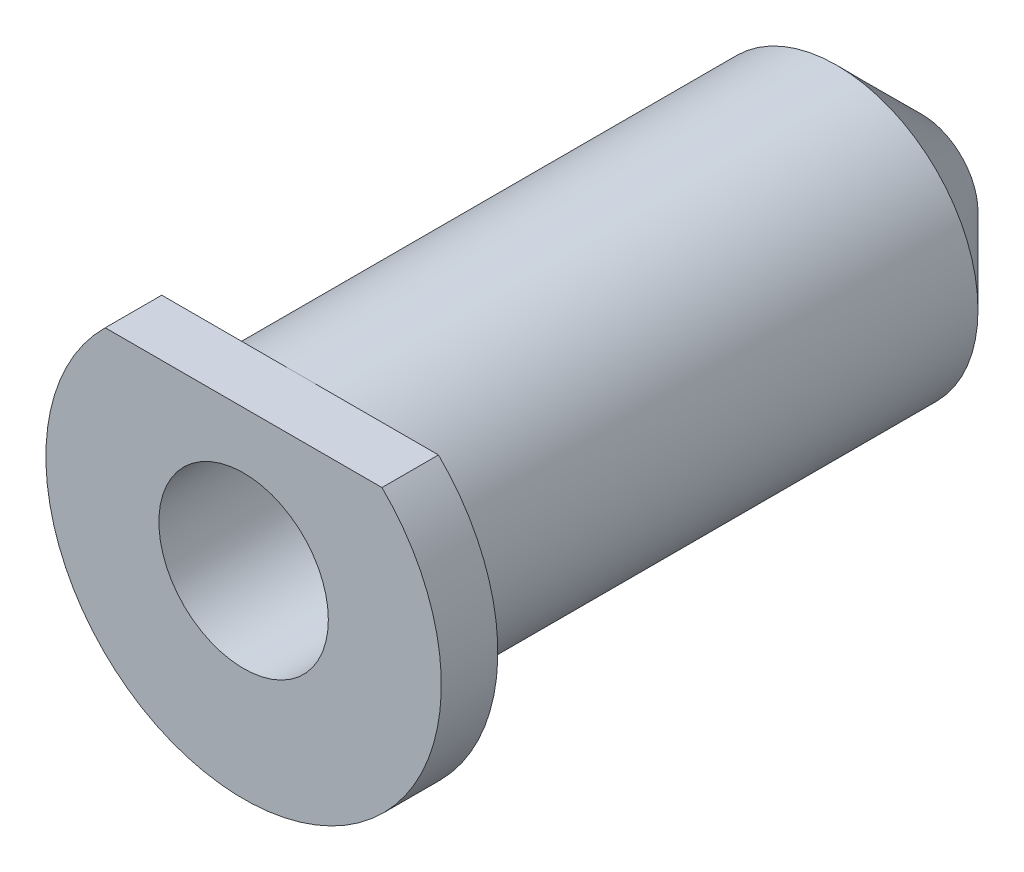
ISO-10303-21;
HEADER;
FILE_DESCRIPTION(('STEP AP214'),'2;1');
FILE_NAME('part.step','',(''),(''),'','','');
FILE_SCHEMA(('AUTOMOTIVE_DESIGN { 1 0 10303 214 1 1 1 1 }'));
ENDSEC;
DATA;
#1=APPLICATION_CONTEXT('core data for automotive mechanical design processes');
#2=APPLICATION_PROTOCOL_DEFINITION('international standard','automotive_design',2000,#1);
#3=PRODUCT_CONTEXT('',#1,'mechanical');
#4=PRODUCT('Part','Part','',(#3));
#5=PRODUCT_RELATED_PRODUCT_CATEGORY('part','',(#4));
#6=PRODUCT_DEFINITION_FORMATION('','',#4);
#7=PRODUCT_DEFINITION_CONTEXT('part definition',#1,'design');
#8=PRODUCT_DEFINITION('design','',#6,#7);
#9=PRODUCT_DEFINITION_SHAPE('','',#8);
#10=(LENGTH_UNIT() NAMED_UNIT(*) SI_UNIT(.MILLI.,.METRE.));
#11=(NAMED_UNIT(*) PLANE_ANGLE_UNIT() SI_UNIT($,.RADIAN.));
#12=(NAMED_UNIT(*) SI_UNIT($,.STERADIAN.) SOLID_ANGLE_UNIT());
#13=UNCERTAINTY_MEASURE_WITH_UNIT(LENGTH_MEASURE(1.E-05),#10,'distance_accuracy_value','');
#14=(GEOMETRIC_REPRESENTATION_CONTEXT(3) GLOBAL_UNCERTAINTY_ASSIGNED_CONTEXT((#13)) GLOBAL_UNIT_ASSIGNED_CONTEXT((#10,
#11,#12)) REPRESENTATION_CONTEXT('',''));
#15=CARTESIAN_POINT('',(0.,0.,0.));
#16=DIRECTION('',(0.,0.,1.));
#17=DIRECTION('',(1.,0.,0.));
#18=AXIS2_PLACEMENT_3D('',#15,#16,#17);
#19=CARTESIAN_POINT('',(0.,0.,22.));
#20=DIRECTION('',(0.,0.,-1.));
#21=DIRECTION('',(-1.,0.,0.));
#22=AXIS2_PLACEMENT_3D('',#19,#20,#21);
#23=CYLINDRICAL_SURFACE('',#22,5.);
#24=CARTESIAN_POINT('',(0.,0.,3.));
#25=DIRECTION('',(0.,0.,1.));
#26=DIRECTION('',(1.,0.,0.));
#27=AXIS2_PLACEMENT_3D('',#24,#25,#26);
#28=CIRCLE('',#27,5.);
#29=CARTESIAN_POINT('',(5.,0.,3.));
#30=VERTEX_POINT('',#29);
#31=EDGE_CURVE('E88',#30,#30,#28,.T.);
#32=ORIENTED_EDGE('',*,*,#31,.T.);
#33=EDGE_LOOP('',(#32));
#34=FACE_BOUND('',#33,.T.);
#35=CARTESIAN_POINT('',(0.,0.,22.));
#36=DIRECTION('',(0.,0.,1.));
#37=DIRECTION('',(1.,0.,0.));
#38=AXIS2_PLACEMENT_3D('',#35,#36,#37);
#39=CIRCLE('',#38,5.);
#40=CARTESIAN_POINT('',(0.,5.,22.));
#41=VERTEX_POINT('',#40);
#42=EDGE_CURVE('E74',#41,#41,#39,.T.);
#43=ORIENTED_EDGE('',*,*,#42,.F.);
#44=EDGE_LOOP('',(#43));
#45=FACE_BOUND('',#44,.T.);
#46=ADVANCED_FACE('F33',(#34,#45),#23,.T.);
#47=CARTESIAN_POINT('',(0.,0.,0.));
#48=DIRECTION('',(0.,0.,1.));
#49=DIRECTION('',(1.,0.,0.));
#50=AXIS2_PLACEMENT_3D('',#47,#48,#49);
#51=PLANE('',#50);
#52=CARTESIAN_POINT('',(0.,0.,0.));
#53=DIRECTION('',(0.,0.,1.));
#54=DIRECTION('',(1.,0.,0.));
#55=AXIS2_PLACEMENT_3D('',#52,#53,#54);
#56=CIRCLE('',#55,1.5);
#57=CARTESIAN_POINT('',(1.5,0.,0.));
#58=VERTEX_POINT('',#57);
#59=EDGE_CURVE('E94',#58,#58,#56,.T.);
#60=ORIENTED_EDGE('',*,*,#59,.T.);
#61=EDGE_LOOP('',(#60));
#62=FACE_BOUND('',#61,.T.);
#63=CARTESIAN_POINT('',(0.,0.,0.));
#64=DIRECTION('',(0.,0.,1.));
#65=DIRECTION('',(1.,0.,0.));
#66=AXIS2_PLACEMENT_3D('',#63,#64,#65);
#67=CIRCLE('',#66,2.);
#68=CARTESIAN_POINT('',(2.,0.,0.));
#69=VERTEX_POINT('',#68);
#70=EDGE_CURVE('E41',#69,#69,#67,.F.);
#71=ORIENTED_EDGE('',*,*,#70,.T.);
#72=EDGE_LOOP('',(#71));
#73=FACE_BOUND('',#72,.T.);
#74=ADVANCED_FACE('F103',(#62,#73),#51,.F.);
#75=CARTESIAN_POINT('',(0.,0.,22.));
#76=DIRECTION('',(0.,0.,1.));
#77=DIRECTION('',(1.,0.,0.));
#78=AXIS2_PLACEMENT_3D('',#75,#76,#77);
#79=PLANE('',#78);
#80=CARTESIAN_POINT('',(0.,0.,22.));
#81=DIRECTION('',(0.,0.,1.));
#82=DIRECTION('',(1.,0.,0.));
#83=AXIS2_PLACEMENT_3D('',#80,#81,#82);
#84=CIRCLE('',#83,7.);
#85=CARTESIAN_POINT('',(-4.89897948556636,5.,22.));
#86=VERTEX_POINT('',#85);
#87=CARTESIAN_POINT('',(4.89897948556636,5.,22.));
#88=VERTEX_POINT('',#87);
#89=EDGE_CURVE('E72',#86,#88,#84,.T.);
#90=ORIENTED_EDGE('',*,*,#89,.F.);
#91=DIRECTION('',(-1.,0.,0.));
#92=VECTOR('',#91,1.);
#93=CARTESIAN_POINT('',(6.,5.,22.));
#94=LINE('',#93,#92);
#95=EDGE_CURVE('E75',#41,#86,#94,.T.);
#96=ORIENTED_EDGE('',*,*,#95,.F.);
#97=ORIENTED_EDGE('',*,*,#42,.T.);
#98=EDGE_CURVE('E61',#88,#41,#94,.T.);
#99=ORIENTED_EDGE('',*,*,#98,.F.);
#100=EDGE_LOOP('',(#90,#96,#97,#99));
#101=FACE_BOUND('',#100,.T.);
#102=ADVANCED_FACE('F71',(#101),#79,.F.);
#103=CARTESIAN_POINT('',(0.,0.,24.));
#104=DIRECTION('',(0.,0.,-1.));
#105=DIRECTION('',(-1.,0.,0.));
#106=AXIS2_PLACEMENT_3D('',#103,#104,#105);
#107=CYLINDRICAL_SURFACE('',#106,7.);
#108=CARTESIAN_POINT('',(0.,0.,24.));
#109=DIRECTION('',(0.,0.,1.));
#110=DIRECTION('',(1.,0.,0.));
#111=AXIS2_PLACEMENT_3D('',#108,#109,#110);
#112=CIRCLE('',#111,7.);
#113=CARTESIAN_POINT('',(-4.89897948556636,5.,24.));
#114=VERTEX_POINT('',#113);
#115=CARTESIAN_POINT('',(4.89897948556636,5.,24.));
#116=VERTEX_POINT('',#115);
#117=EDGE_CURVE('E78',#114,#116,#112,.T.);
#118=ORIENTED_EDGE('',*,*,#117,.F.);
#119=DIRECTION('',(0.,0.,-1.));
#120=VECTOR('',#119,1.);
#121=CARTESIAN_POINT('',(-4.89897948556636,5.,24.));
#122=LINE('',#121,#120);
#123=EDGE_CURVE('E47',#114,#86,#122,.T.);
#124=ORIENTED_EDGE('',*,*,#123,.T.);
#125=ORIENTED_EDGE('',*,*,#89,.T.);
#126=DIRECTION('',(0.,0.,-1.));
#127=VECTOR('',#126,1.);
#128=CARTESIAN_POINT('',(4.89897948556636,5.,24.));
#129=LINE('',#128,#127);
#130=EDGE_CURVE('E58',#88,#116,#129,.F.);
#131=ORIENTED_EDGE('',*,*,#130,.T.);
#132=EDGE_LOOP('',(#118,#124,#125,#131));
#133=FACE_BOUND('',#132,.T.);
#134=ADVANCED_FACE('F77',(#133),#107,.T.);
#135=CARTESIAN_POINT('',(0.,0.,24.));
#136=DIRECTION('',(0.,0.,1.));
#137=DIRECTION('',(1.,0.,0.));
#138=AXIS2_PLACEMENT_3D('',#135,#136,#137);
#139=PLANE('',#138);
#140=DIRECTION('',(1.,0.,0.));
#141=VECTOR('',#140,1.);
#142=CARTESIAN_POINT('',(0.,5.,24.));
#143=LINE('',#142,#141);
#144=EDGE_CURVE('E11',#114,#116,#143,.T.);
#145=ORIENTED_EDGE('',*,*,#144,.F.);
#146=ORIENTED_EDGE('',*,*,#117,.T.);
#147=EDGE_LOOP('',(#145,#146));
#148=FACE_BOUND('',#147,.T.);
#149=CARTESIAN_POINT('',(0.,0.,24.));
#150=DIRECTION('',(0.,0.,1.));
#151=DIRECTION('',(1.,0.,0.));
#152=AXIS2_PLACEMENT_3D('',#149,#150,#151);
#153=CIRCLE('',#152,3.);
#154=CARTESIAN_POINT('',(3.,0.,24.));
#155=VERTEX_POINT('',#154);
#156=EDGE_CURVE('E83',#155,#155,#153,.T.);
#157=ORIENTED_EDGE('',*,*,#156,.F.);
#158=EDGE_LOOP('',(#157));
#159=FACE_BOUND('',#158,.T.);
#160=ADVANCED_FACE('F130',(#148,#159),#139,.T.);
#161=CARTESIAN_POINT('',(0.,0.,3.));
#162=DIRECTION('',(0.,0.,1.));
#163=DIRECTION('',(1.,0.,0.));
#164=AXIS2_PLACEMENT_3D('',#161,#162,#163);
#165=CONICAL_SURFACE('',#164,5.,0.78539816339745);
#166=ORIENTED_EDGE('',*,*,#70,.F.);
#167=EDGE_LOOP('',(#166));
#168=FACE_BOUND('',#167,.T.);
#169=ORIENTED_EDGE('',*,*,#31,.F.);
#170=EDGE_LOOP('',(#169));
#171=FACE_BOUND('',#170,.T.);
#172=ADVANCED_FACE('F35',(#168,#171),#165,.T.);
#173=CARTESIAN_POINT('',(0.,0.,22.));
#174=DIRECTION('',(0.,0.,-1.));
#175=DIRECTION('',(-1.,0.,0.));
#176=AXIS2_PLACEMENT_3D('',#173,#174,#175);
#177=CYLINDRICAL_SURFACE('',#176,3.);
#178=CARTESIAN_POINT('',(0.,0.,3.82842712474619));
#179=DIRECTION('',(0.,0.,1.));
#180=DIRECTION('',(1.,0.,0.));
#181=AXIS2_PLACEMENT_3D('',#178,#179,#180);
#182=CIRCLE('',#181,3.);
#183=CARTESIAN_POINT('',(3.,0.,3.82842712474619));
#184=VERTEX_POINT('',#183);
#185=EDGE_CURVE('E79',#184,#184,#182,.T.);
#186=ORIENTED_EDGE('',*,*,#185,.F.);
#187=EDGE_LOOP('',(#186));
#188=FACE_BOUND('',#187,.T.);
#189=ORIENTED_EDGE('',*,*,#156,.T.);
#190=EDGE_LOOP('',(#189));
#191=FACE_BOUND('',#190,.T.);
#192=ADVANCED_FACE('F116',(#188,#191),#177,.F.);
#193=CARTESIAN_POINT('',(0.,0.,4.41421356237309));
#194=DIRECTION('',(0.,0.,1.));
#195=DIRECTION('',(1.,0.,0.));
#196=AXIS2_PLACEMENT_3D('',#193,#194,#195);
#197=CONICAL_SURFACE('',#196,3.58578643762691,0.78539816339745);
#198=CARTESIAN_POINT('',(0.,0.,2.32842712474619));
#199=DIRECTION('',(0.,0.,1.));
#200=DIRECTION('',(1.,0.,0.));
#201=AXIS2_PLACEMENT_3D('',#198,#199,#200);
#202=CIRCLE('',#201,1.5);
#203=CARTESIAN_POINT('',(1.5,0.,2.32842712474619));
#204=VERTEX_POINT('',#203);
#205=EDGE_CURVE('E92',#204,#204,#202,.F.);
#206=ORIENTED_EDGE('',*,*,#205,.T.);
#207=EDGE_LOOP('',(#206));
#208=FACE_BOUND('',#207,.T.);
#209=ORIENTED_EDGE('',*,*,#185,.T.);
#210=EDGE_LOOP('',(#209));
#211=FACE_BOUND('',#210,.T.);
#212=ADVANCED_FACE('F109',(#208,#211),#197,.F.);
#213=CARTESIAN_POINT('',(0.,0.,0.));
#214=DIRECTION('',(0.,0.,1.));
#215=DIRECTION('',(1.,0.,0.));
#216=AXIS2_PLACEMENT_3D('',#213,#214,#215);
#217=CYLINDRICAL_SURFACE('',#216,1.5);
#218=ORIENTED_EDGE('',*,*,#59,.F.);
#219=EDGE_LOOP('',(#218));
#220=FACE_BOUND('',#219,.T.);
#221=ORIENTED_EDGE('',*,*,#205,.F.);
#222=EDGE_LOOP('',(#221));
#223=FACE_BOUND('',#222,.T.);
#224=ADVANCED_FACE('F106',(#220,#223),#217,.F.);
#225=CARTESIAN_POINT('',(6.,5.,32.));
#226=DIRECTION('',(0.,-1.,0.));
#227=DIRECTION('',(0.,0.,-1.));
#228=AXIS2_PLACEMENT_3D('',#225,#226,#227);
#229=PLANE('',#228);
#230=ORIENTED_EDGE('',*,*,#144,.T.);
#231=ORIENTED_EDGE('',*,*,#130,.F.);
#232=ORIENTED_EDGE('',*,*,#98,.T.);
#233=ORIENTED_EDGE('',*,*,#95,.T.);
#234=ORIENTED_EDGE('',*,*,#123,.F.);
#235=EDGE_LOOP('',(#230,#231,#232,#233,#234));
#236=FACE_BOUND('',#235,.T.);
#237=ADVANCED_FACE('F60',(#236),#229,.F.);
#238=CLOSED_SHELL('',(#46,#74,#102,#134,#160,#172,#192,#212,#224,#237));
#239=MANIFOLD_SOLID_BREP('B2',#238);
#240=ADVANCED_BREP_SHAPE_REPRESENTATION('',(#18,#239),#14);
#241=SHAPE_DEFINITION_REPRESENTATION(#9,#240);
ENDSEC;
END-ISO-10303-21;
